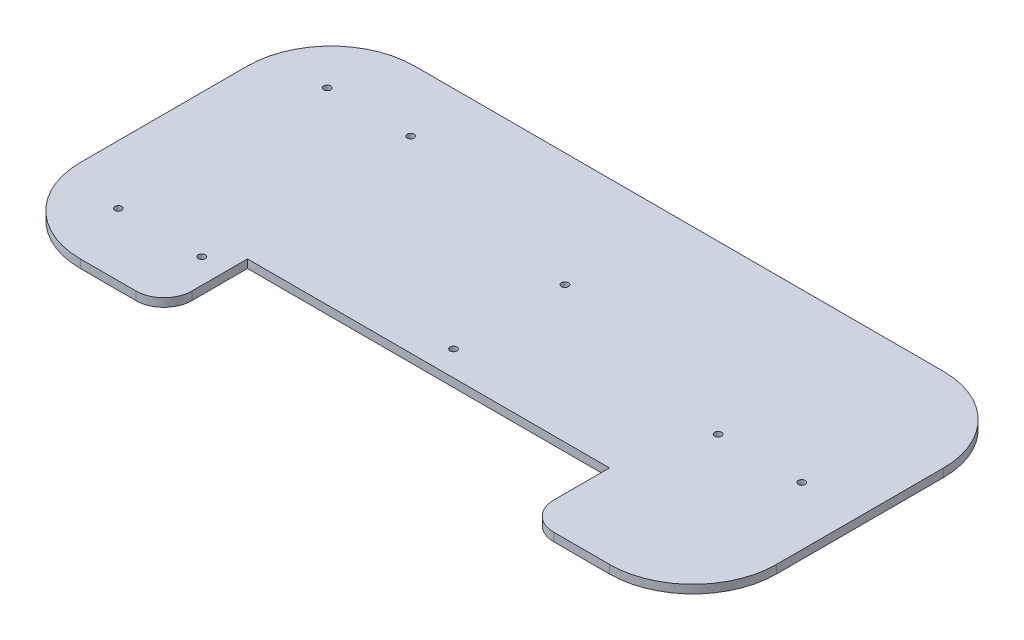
ISO-10303-21;
HEADER;
FILE_DESCRIPTION(('STEP AP214'),'2;1');
FILE_NAME('part.step','',(''),(''),'','','');
FILE_SCHEMA(('AUTOMOTIVE_DESIGN { 1 0 10303 214 1 1 1 1 }'));
ENDSEC;
DATA;
#1=APPLICATION_CONTEXT('core data for automotive mechanical design processes');
#2=APPLICATION_PROTOCOL_DEFINITION('international standard','automotive_design',2000,#1);
#3=PRODUCT_CONTEXT('',#1,'mechanical');
#4=PRODUCT('Part','Part','',(#3));
#5=PRODUCT_RELATED_PRODUCT_CATEGORY('part','',(#4));
#6=PRODUCT_DEFINITION_FORMATION('','',#4);
#7=PRODUCT_DEFINITION_CONTEXT('part definition',#1,'design');
#8=PRODUCT_DEFINITION('design','',#6,#7);
#9=PRODUCT_DEFINITION_SHAPE('','',#8);
#10=(LENGTH_UNIT() NAMED_UNIT(*) SI_UNIT(.MILLI.,.METRE.));
#11=(NAMED_UNIT(*) PLANE_ANGLE_UNIT() SI_UNIT($,.RADIAN.));
#12=(NAMED_UNIT(*) SI_UNIT($,.STERADIAN.) SOLID_ANGLE_UNIT());
#13=UNCERTAINTY_MEASURE_WITH_UNIT(LENGTH_MEASURE(1.E-05),#10,'distance_accuracy_value','');
#14=(GEOMETRIC_REPRESENTATION_CONTEXT(3) GLOBAL_UNCERTAINTY_ASSIGNED_CONTEXT((#13)) GLOBAL_UNIT_ASSIGNED_CONTEXT((#10,
#11,#12)) REPRESENTATION_CONTEXT('',''));
#15=CARTESIAN_POINT('',(0.,0.,0.));
#16=DIRECTION('',(0.,0.,1.));
#17=DIRECTION('',(1.,0.,0.));
#18=AXIS2_PLACEMENT_3D('',#15,#16,#17);
#19=CARTESIAN_POINT('',(-125.,3.,60.));
#20=DIRECTION('',(0.,0.,-1.));
#21=DIRECTION('',(-1.,0.,0.));
#22=AXIS2_PLACEMENT_3D('',#19,#20,#21);
#23=PLANE('',#22);
#24=DIRECTION('',(1.,0.,0.));
#25=VECTOR('',#24,1.);
#26=CARTESIAN_POINT('',(-125.,0.,60.));
#27=LINE('',#26,#25);
#28=CARTESIAN_POINT('',(-95.,0.,60.));
#29=VERTEX_POINT('',#28);
#30=CARTESIAN_POINT('',(-75.,0.,60.));
#31=VERTEX_POINT('',#30);
#32=EDGE_CURVE('E167',#29,#31,#27,.T.);
#33=ORIENTED_EDGE('',*,*,#32,.T.);
#34=DIRECTION('',(0.,-1.,0.));
#35=VECTOR('',#34,1.);
#36=CARTESIAN_POINT('',(-75.,3.,60.));
#37=LINE('',#36,#35);
#38=CARTESIAN_POINT('',(-75.,3.,60.));
#39=VERTEX_POINT('',#38);
#40=EDGE_CURVE('E232',#31,#39,#37,.F.);
#41=ORIENTED_EDGE('',*,*,#40,.T.);
#42=DIRECTION('',(1.,0.,0.));
#43=VECTOR('',#42,1.);
#44=CARTESIAN_POINT('',(-125.,3.,60.));
#45=LINE('',#44,#43);
#46=CARTESIAN_POINT('',(-95.,3.,60.));
#47=VERTEX_POINT('',#46);
#48=EDGE_CURVE('E174',#47,#39,#45,.T.);
#49=ORIENTED_EDGE('',*,*,#48,.F.);
#50=DIRECTION('',(0.,-1.,0.));
#51=VECTOR('',#50,1.);
#52=CARTESIAN_POINT('',(-95.,3.,60.));
#53=LINE('',#52,#51);
#54=EDGE_CURVE('E218',#47,#29,#53,.T.);
#55=ORIENTED_EDGE('',*,*,#54,.T.);
#56=EDGE_LOOP('',(#33,#41,#49,#55));
#57=FACE_BOUND('',#56,.T.);
#58=ADVANCED_FACE('F32',(#57),#23,.F.);
#59=CARTESIAN_POINT('',(125.,3.,-60.));
#60=DIRECTION('',(-1.,0.,0.));
#61=DIRECTION('',(0.,0.,1.));
#62=AXIS2_PLACEMENT_3D('',#59,#60,#61);
#63=PLANE('',#62);
#64=DIRECTION('',(0.,0.,-1.));
#65=VECTOR('',#64,1.);
#66=CARTESIAN_POINT('',(125.,0.,-60.));
#67=LINE('',#66,#65);
#68=CARTESIAN_POINT('',(125.,0.,30.));
#69=VERTEX_POINT('',#68);
#70=CARTESIAN_POINT('',(125.,0.,-30.));
#71=VERTEX_POINT('',#70);
#72=EDGE_CURVE('E162',#69,#71,#67,.T.);
#73=ORIENTED_EDGE('',*,*,#72,.T.);
#74=DIRECTION('',(0.,-1.,0.));
#75=VECTOR('',#74,1.);
#76=CARTESIAN_POINT('',(125.,3.,-30.));
#77=LINE('',#76,#75);
#78=CARTESIAN_POINT('',(125.,3.,-30.));
#79=VERTEX_POINT('',#78);
#80=EDGE_CURVE('E224',#71,#79,#77,.F.);
#81=ORIENTED_EDGE('',*,*,#80,.T.);
#82=DIRECTION('',(0.,0.,-1.));
#83=VECTOR('',#82,1.);
#84=CARTESIAN_POINT('',(125.,3.,-60.));
#85=LINE('',#84,#83);
#86=CARTESIAN_POINT('',(125.,3.,30.));
#87=VERTEX_POINT('',#86);
#88=EDGE_CURVE('E163',#87,#79,#85,.T.);
#89=ORIENTED_EDGE('',*,*,#88,.F.);
#90=DIRECTION('',(0.,-1.,0.));
#91=VECTOR('',#90,1.);
#92=CARTESIAN_POINT('',(125.,3.,30.));
#93=LINE('',#92,#91);
#94=EDGE_CURVE('E221',#87,#69,#93,.T.);
#95=ORIENTED_EDGE('',*,*,#94,.T.);
#96=EDGE_LOOP('',(#73,#81,#89,#95));
#97=FACE_BOUND('',#96,.T.);
#98=ADVANCED_FACE('F251',(#97),#63,.F.);
#99=CARTESIAN_POINT('',(-125.,3.,-60.));
#100=DIRECTION('',(0.,0.,1.));
#101=DIRECTION('',(1.,0.,0.));
#102=AXIS2_PLACEMENT_3D('',#99,#100,#101);
#103=PLANE('',#102);
#104=DIRECTION('',(-1.,0.,0.));
#105=VECTOR('',#104,1.);
#106=CARTESIAN_POINT('',(-125.,0.,-60.));
#107=LINE('',#106,#105);
#108=CARTESIAN_POINT('',(95.,0.,-60.));
#109=VERTEX_POINT('',#108);
#110=CARTESIAN_POINT('',(-95.,0.,-60.));
#111=VERTEX_POINT('',#110);
#112=EDGE_CURVE('E180',#109,#111,#107,.T.);
#113=ORIENTED_EDGE('',*,*,#112,.T.);
#114=DIRECTION('',(0.,-1.,0.));
#115=VECTOR('',#114,1.);
#116=CARTESIAN_POINT('',(-95.,3.,-60.));
#117=LINE('',#116,#115);
#118=CARTESIAN_POINT('',(-95.,3.,-60.));
#119=VERTEX_POINT('',#118);
#120=EDGE_CURVE('E205',#111,#119,#117,.F.);
#121=ORIENTED_EDGE('',*,*,#120,.T.);
#122=DIRECTION('',(-1.,0.,0.));
#123=VECTOR('',#122,1.);
#124=CARTESIAN_POINT('',(-125.,3.,-60.));
#125=LINE('',#124,#123);
#126=CARTESIAN_POINT('',(95.,3.,-60.));
#127=VERTEX_POINT('',#126);
#128=EDGE_CURVE('E166',#127,#119,#125,.T.);
#129=ORIENTED_EDGE('',*,*,#128,.F.);
#130=DIRECTION('',(0.,-1.,0.));
#131=VECTOR('',#130,1.);
#132=CARTESIAN_POINT('',(95.,3.,-60.));
#133=LINE('',#132,#131);
#134=EDGE_CURVE('E202',#127,#109,#133,.T.);
#135=ORIENTED_EDGE('',*,*,#134,.T.);
#136=EDGE_LOOP('',(#113,#121,#129,#135));
#137=FACE_BOUND('',#136,.T.);
#138=ADVANCED_FACE('F259',(#137),#103,.F.);
#139=CARTESIAN_POINT('',(-125.,3.,-60.));
#140=DIRECTION('',(1.,0.,0.));
#141=DIRECTION('',(0.,0.,-1.));
#142=AXIS2_PLACEMENT_3D('',#139,#140,#141);
#143=PLANE('',#142);
#144=DIRECTION('',(0.,0.,1.));
#145=VECTOR('',#144,1.);
#146=CARTESIAN_POINT('',(-125.,3.,-60.));
#147=LINE('',#146,#145);
#148=CARTESIAN_POINT('',(-125.,3.,-30.));
#149=VERTEX_POINT('',#148);
#150=CARTESIAN_POINT('',(-125.,3.,30.));
#151=VERTEX_POINT('',#150);
#152=EDGE_CURVE('E170',#149,#151,#147,.T.);
#153=ORIENTED_EDGE('',*,*,#152,.F.);
#154=DIRECTION('',(0.,-1.,0.));
#155=VECTOR('',#154,1.);
#156=CARTESIAN_POINT('',(-125.,3.,-30.));
#157=LINE('',#156,#155);
#158=CARTESIAN_POINT('',(-125.,0.,-30.));
#159=VERTEX_POINT('',#158);
#160=EDGE_CURVE('E190',#149,#159,#157,.T.);
#161=ORIENTED_EDGE('',*,*,#160,.T.);
#162=DIRECTION('',(0.,0.,1.));
#163=VECTOR('',#162,1.);
#164=CARTESIAN_POINT('',(-125.,0.,-60.));
#165=LINE('',#164,#163);
#166=CARTESIAN_POINT('',(-125.,0.,30.));
#167=VERTEX_POINT('',#166);
#168=EDGE_CURVE('E183',#159,#167,#165,.T.);
#169=ORIENTED_EDGE('',*,*,#168,.T.);
#170=DIRECTION('',(0.,-1.,0.));
#171=VECTOR('',#170,1.);
#172=CARTESIAN_POINT('',(-125.,3.,30.));
#173=LINE('',#172,#171);
#174=EDGE_CURVE('E177',#167,#151,#173,.F.);
#175=ORIENTED_EDGE('',*,*,#174,.T.);
#176=EDGE_LOOP('',(#153,#161,#169,#175));
#177=FACE_BOUND('',#176,.T.);
#178=ADVANCED_FACE('F268',(#177),#143,.F.);
#179=CARTESIAN_POINT('',(75.,3.,60.));
#180=VERTEX_POINT('',#179);
#181=CARTESIAN_POINT('',(95.,3.,60.));
#182=VERTEX_POINT('',#181);
#183=EDGE_CURVE('E173',#180,#182,#45,.T.);
#184=ORIENTED_EDGE('',*,*,#183,.F.);
#185=DIRECTION('',(0.,-1.,0.));
#186=VECTOR('',#185,1.);
#187=CARTESIAN_POINT('',(75.,3.,60.));
#188=LINE('',#187,#186);
#189=CARTESIAN_POINT('',(75.,0.,60.));
#190=VERTEX_POINT('',#189);
#191=EDGE_CURVE('E40',#180,#190,#188,.T.);
#192=ORIENTED_EDGE('',*,*,#191,.T.);
#193=CARTESIAN_POINT('',(95.,0.,60.));
#194=VERTEX_POINT('',#193);
#195=EDGE_CURVE('E186',#190,#194,#27,.T.);
#196=ORIENTED_EDGE('',*,*,#195,.T.);
#197=DIRECTION('',(0.,-1.,0.));
#198=VECTOR('',#197,1.);
#199=CARTESIAN_POINT('',(95.,3.,60.));
#200=LINE('',#199,#198);
#201=EDGE_CURVE('E215',#194,#182,#200,.F.);
#202=ORIENTED_EDGE('',*,*,#201,.T.);
#203=EDGE_LOOP('',(#184,#192,#196,#202));
#204=FACE_BOUND('',#203,.T.);
#205=ADVANCED_FACE('F239',(#204),#23,.F.);
#206=CARTESIAN_POINT('',(0.,3.,0.));
#207=DIRECTION('',(0.,1.,0.));
#208=DIRECTION('',(0.,0.,1.));
#209=AXIS2_PLACEMENT_3D('',#206,#207,#208);
#210=PLANE('',#209);
#211=CARTESIAN_POINT('',(104.028688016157,3.,0.));
#212=DIRECTION('',(0.,-1.,0.));
#213=DIRECTION('',(0.,0.,-1.));
#214=AXIS2_PLACEMENT_3D('',#211,#212,#213);
#215=CIRCLE('',#214,1.25);
#216=CARTESIAN_POINT('',(104.028688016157,3.,-1.25000000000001));
#217=VERTEX_POINT('',#216);
#218=EDGE_CURVE('E285',#217,#217,#215,.T.);
#219=ORIENTED_EDGE('',*,*,#218,.T.);
#220=EDGE_LOOP('',(#219));
#221=FACE_BOUND('',#220,.T.);
#222=CARTESIAN_POINT('',(-73.8835490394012,3.,-37.4999999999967));
#223=DIRECTION('',(0.,-1.,0.));
#224=DIRECTION('',(0.,0.,-1.));
#225=AXIS2_PLACEMENT_3D('',#222,#223,#224);
#226=CIRCLE('',#225,1.25);
#227=CARTESIAN_POINT('',(-73.8835490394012,3.,-38.7499999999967));
#228=VERTEX_POINT('',#227);
#229=EDGE_CURVE('E318',#228,#228,#226,.T.);
#230=ORIENTED_EDGE('',*,*,#229,.T.);
#231=EDGE_LOOP('',(#230));
#232=FACE_BOUND('',#231,.T.);
#233=CARTESIAN_POINT('',(-103.883549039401,3.,-37.4999999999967));
#234=DIRECTION('',(0.,-1.,0.));
#235=DIRECTION('',(0.,0.,-1.));
#236=AXIS2_PLACEMENT_3D('',#233,#234,#235);
#237=CIRCLE('',#236,1.25);
#238=CARTESIAN_POINT('',(-103.883549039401,3.,-38.7499999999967));
#239=VERTEX_POINT('',#238);
#240=EDGE_CURVE('E324',#239,#239,#237,.T.);
#241=ORIENTED_EDGE('',*,*,#240,.T.);
#242=EDGE_LOOP('',(#241));
#243=FACE_BOUND('',#242,.T.);
#244=CARTESIAN_POINT('',(-103.883549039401,3.,37.5000000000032));
#245=DIRECTION('',(0.,-1.,0.));
#246=DIRECTION('',(0.,0.,-1.));
#247=AXIS2_PLACEMENT_3D('',#244,#245,#246);
#248=CIRCLE('',#247,1.25);
#249=CARTESIAN_POINT('',(-103.883549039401,3.,36.2500000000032));
#250=VERTEX_POINT('',#249);
#251=EDGE_CURVE('E307',#250,#250,#248,.T.);
#252=ORIENTED_EDGE('',*,*,#251,.T.);
#253=EDGE_LOOP('',(#252));
#254=FACE_BOUND('',#253,.T.);
#255=CARTESIAN_POINT('',(74.0286880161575,3.,0.));
#256=DIRECTION('',(0.,-1.,0.));
#257=DIRECTION('',(0.,0.,-1.));
#258=AXIS2_PLACEMENT_3D('',#255,#256,#257);
#259=CIRCLE('',#258,1.25);
#260=CARTESIAN_POINT('',(74.0286880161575,3.,-1.25000000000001));
#261=VERTEX_POINT('',#260);
#262=EDGE_CURVE('E300',#261,#261,#259,.T.);
#263=ORIENTED_EDGE('',*,*,#262,.T.);
#264=EDGE_LOOP('',(#263));
#265=FACE_BOUND('',#264,.T.);
#266=CARTESIAN_POINT('',(0.,3.,20.9999999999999));
#267=DIRECTION('',(0.,-1.,0.));
#268=DIRECTION('',(0.,0.,-1.));
#269=AXIS2_PLACEMENT_3D('',#266,#267,#268);
#270=CIRCLE('',#269,1.25);
#271=CARTESIAN_POINT('',(0.,3.,19.7499999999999));
#272=VERTEX_POINT('',#271);
#273=EDGE_CURVE('E293',#272,#272,#270,.T.);
#274=ORIENTED_EDGE('',*,*,#273,.T.);
#275=EDGE_LOOP('',(#274));
#276=FACE_BOUND('',#275,.T.);
#277=CARTESIAN_POINT('',(0.,3.,-19.0000000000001));
#278=DIRECTION('',(0.,-1.,0.));
#279=DIRECTION('',(0.,0.,-1.));
#280=AXIS2_PLACEMENT_3D('',#277,#278,#279);
#281=CIRCLE('',#280,1.25);
#282=CARTESIAN_POINT('',(0.,3.,-20.2500000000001));
#283=VERTEX_POINT('',#282);
#284=EDGE_CURVE('E294',#283,#283,#281,.T.);
#285=ORIENTED_EDGE('',*,*,#284,.T.);
#286=EDGE_LOOP('',(#285));
#287=FACE_BOUND('',#286,.T.);
#288=CARTESIAN_POINT('',(-73.8835490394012,3.,37.5000000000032));
#289=DIRECTION('',(0.,-1.,0.));
#290=DIRECTION('',(0.,0.,-1.));
#291=AXIS2_PLACEMENT_3D('',#288,#289,#290);
#292=CIRCLE('',#291,1.25);
#293=CARTESIAN_POINT('',(-73.8835490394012,3.,36.2500000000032));
#294=VERTEX_POINT('',#293);
#295=EDGE_CURVE('E306',#294,#294,#292,.T.);
#296=ORIENTED_EDGE('',*,*,#295,.T.);
#297=EDGE_LOOP('',(#296));
#298=FACE_BOUND('',#297,.T.);
#299=ORIENTED_EDGE('',*,*,#48,.T.);
#300=CARTESIAN_POINT('',(-75.,3.,50.));
#301=DIRECTION('',(0.,1.,0.));
#302=DIRECTION('',(0.,0.,1.));
#303=AXIS2_PLACEMENT_3D('',#300,#301,#302);
#304=CIRCLE('',#303,10.);
#305=CARTESIAN_POINT('',(-65.,3.,50.));
#306=VERTEX_POINT('',#305);
#307=EDGE_CURVE('E235',#39,#306,#304,.T.);
#308=ORIENTED_EDGE('',*,*,#307,.T.);
#309=DIRECTION('',(0.,0.,1.));
#310=VECTOR('',#309,1.);
#311=CARTESIAN_POINT('',(-65.,3.,0.));
#312=LINE('',#311,#310);
#313=CARTESIAN_POINT('',(-65.,3.,30.));
#314=VERTEX_POINT('',#313);
#315=EDGE_CURVE('E159',#314,#306,#312,.T.);
#316=ORIENTED_EDGE('',*,*,#315,.F.);
#317=DIRECTION('',(-1.,0.,0.));
#318=VECTOR('',#317,1.);
#319=CARTESIAN_POINT('',(0.,3.,30.));
#320=LINE('',#319,#318);
#321=CARTESIAN_POINT('',(65.,3.,30.));
#322=VERTEX_POINT('',#321);
#323=EDGE_CURVE('E138',#322,#314,#320,.T.);
#324=ORIENTED_EDGE('',*,*,#323,.F.);
#325=DIRECTION('',(0.,0.,-1.));
#326=VECTOR('',#325,1.);
#327=CARTESIAN_POINT('',(65.,3.,0.));
#328=LINE('',#327,#326);
#329=CARTESIAN_POINT('',(65.,3.,50.));
#330=VERTEX_POINT('',#329);
#331=EDGE_CURVE('E135',#330,#322,#328,.T.);
#332=ORIENTED_EDGE('',*,*,#331,.F.);
#333=CARTESIAN_POINT('',(75.,3.,50.));
#334=DIRECTION('',(0.,1.,0.));
#335=DIRECTION('',(0.,0.,1.));
#336=AXIS2_PLACEMENT_3D('',#333,#334,#335);
#337=CIRCLE('',#336,10.);
#338=EDGE_CURVE('E47',#330,#180,#337,.T.);
#339=ORIENTED_EDGE('',*,*,#338,.T.);
#340=ORIENTED_EDGE('',*,*,#183,.T.);
#341=CARTESIAN_POINT('',(95.,3.,30.));
#342=DIRECTION('',(0.,1.,0.));
#343=DIRECTION('',(0.,0.,1.));
#344=AXIS2_PLACEMENT_3D('',#341,#342,#343);
#345=CIRCLE('',#344,30.);
#346=EDGE_CURVE('E207',#182,#87,#345,.T.);
#347=ORIENTED_EDGE('',*,*,#346,.T.);
#348=ORIENTED_EDGE('',*,*,#88,.T.);
#349=CARTESIAN_POINT('',(95.,3.,-30.));
#350=DIRECTION('',(0.,1.,0.));
#351=DIRECTION('',(0.,0.,1.));
#352=AXIS2_PLACEMENT_3D('',#349,#350,#351);
#353=CIRCLE('',#352,30.);
#354=EDGE_CURVE('E209',#79,#127,#353,.T.);
#355=ORIENTED_EDGE('',*,*,#354,.T.);
#356=ORIENTED_EDGE('',*,*,#128,.T.);
#357=CARTESIAN_POINT('',(-95.,3.,-30.));
#358=DIRECTION('',(0.,1.,0.));
#359=DIRECTION('',(0.,0.,1.));
#360=AXIS2_PLACEMENT_3D('',#357,#358,#359);
#361=CIRCLE('',#360,30.);
#362=EDGE_CURVE('E213',#119,#149,#361,.T.);
#363=ORIENTED_EDGE('',*,*,#362,.T.);
#364=ORIENTED_EDGE('',*,*,#152,.T.);
#365=CARTESIAN_POINT('',(-95.,3.,30.));
#366=DIRECTION('',(0.,1.,0.));
#367=DIRECTION('',(0.,0.,1.));
#368=AXIS2_PLACEMENT_3D('',#365,#366,#367);
#369=CIRCLE('',#368,30.);
#370=EDGE_CURVE('E211',#151,#47,#369,.T.);
#371=ORIENTED_EDGE('',*,*,#370,.T.);
#372=EDGE_LOOP('',(#299,#308,#316,#324,#332,#339,#340,#347,#348,#355,#356,#363,#364,#371));
#373=FACE_BOUND('',#372,.T.);
#374=ADVANCED_FACE('F248',(#221,#232,#243,#254,#265,#276,#287,#298,#373),#210,.T.);
#375=CARTESIAN_POINT('',(0.,0.,0.));
#376=DIRECTION('',(0.,1.,0.));
#377=DIRECTION('',(0.,0.,1.));
#378=AXIS2_PLACEMENT_3D('',#375,#376,#377);
#379=PLANE('',#378);
#380=CARTESIAN_POINT('',(104.028688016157,0.,0.));
#381=DIRECTION('',(0.,-1.,0.));
#382=DIRECTION('',(0.,0.,-1.));
#383=AXIS2_PLACEMENT_3D('',#380,#381,#382);
#384=CIRCLE('',#383,1.25);
#385=CARTESIAN_POINT('',(104.028688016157,0.,-1.25000000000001));
#386=VERTEX_POINT('',#385);
#387=EDGE_CURVE('E287',#386,#386,#384,.T.);
#388=ORIENTED_EDGE('',*,*,#387,.F.);
#389=EDGE_LOOP('',(#388));
#390=FACE_BOUND('',#389,.T.);
#391=CARTESIAN_POINT('',(-73.8835490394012,0.,-37.4999999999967));
#392=DIRECTION('',(0.,-1.,0.));
#393=DIRECTION('',(0.,0.,-1.));
#394=AXIS2_PLACEMENT_3D('',#391,#392,#393);
#395=CIRCLE('',#394,1.25);
#396=CARTESIAN_POINT('',(-73.8835490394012,0.,-38.7499999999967));
#397=VERTEX_POINT('',#396);
#398=EDGE_CURVE('E315',#397,#397,#395,.T.);
#399=ORIENTED_EDGE('',*,*,#398,.F.);
#400=EDGE_LOOP('',(#399));
#401=FACE_BOUND('',#400,.T.);
#402=CARTESIAN_POINT('',(-103.883549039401,0.,-37.4999999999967));
#403=DIRECTION('',(0.,-1.,0.));
#404=DIRECTION('',(0.,0.,-1.));
#405=AXIS2_PLACEMENT_3D('',#402,#403,#404);
#406=CIRCLE('',#405,1.25);
#407=CARTESIAN_POINT('',(-103.883549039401,0.,-38.7499999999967));
#408=VERTEX_POINT('',#407);
#409=EDGE_CURVE('E321',#408,#408,#406,.T.);
#410=ORIENTED_EDGE('',*,*,#409,.F.);
#411=EDGE_LOOP('',(#410));
#412=FACE_BOUND('',#411,.T.);
#413=CARTESIAN_POINT('',(-103.883549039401,0.,37.5000000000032));
#414=DIRECTION('',(0.,-1.,0.));
#415=DIRECTION('',(0.,0.,-1.));
#416=AXIS2_PLACEMENT_3D('',#413,#414,#415);
#417=CIRCLE('',#416,1.25);
#418=CARTESIAN_POINT('',(-103.883549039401,0.,36.2500000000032));
#419=VERTEX_POINT('',#418);
#420=EDGE_CURVE('E327',#419,#419,#417,.T.);
#421=ORIENTED_EDGE('',*,*,#420,.F.);
#422=EDGE_LOOP('',(#421));
#423=FACE_BOUND('',#422,.T.);
#424=CARTESIAN_POINT('',(74.0286880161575,0.,0.));
#425=DIRECTION('',(0.,-1.,0.));
#426=DIRECTION('',(0.,0.,-1.));
#427=AXIS2_PLACEMENT_3D('',#424,#425,#426);
#428=CIRCLE('',#427,1.25);
#429=CARTESIAN_POINT('',(74.0286880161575,0.,-1.25000000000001));
#430=VERTEX_POINT('',#429);
#431=EDGE_CURVE('E297',#430,#430,#428,.T.);
#432=ORIENTED_EDGE('',*,*,#431,.F.);
#433=EDGE_LOOP('',(#432));
#434=FACE_BOUND('',#433,.T.);
#435=CARTESIAN_POINT('',(0.,0.,20.9999999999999));
#436=DIRECTION('',(0.,-1.,0.));
#437=DIRECTION('',(0.,0.,-1.));
#438=AXIS2_PLACEMENT_3D('',#435,#436,#437);
#439=CIRCLE('',#438,1.25);
#440=CARTESIAN_POINT('',(0.,0.,19.7499999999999));
#441=VERTEX_POINT('',#440);
#442=EDGE_CURVE('E290',#441,#441,#439,.T.);
#443=ORIENTED_EDGE('',*,*,#442,.F.);
#444=EDGE_LOOP('',(#443));
#445=FACE_BOUND('',#444,.T.);
#446=CARTESIAN_POINT('',(0.,0.,-19.0000000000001));
#447=DIRECTION('',(0.,-1.,0.));
#448=DIRECTION('',(0.,0.,-1.));
#449=AXIS2_PLACEMENT_3D('',#446,#447,#448);
#450=CIRCLE('',#449,1.25);
#451=CARTESIAN_POINT('',(0.,0.,-20.2500000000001));
#452=VERTEX_POINT('',#451);
#453=EDGE_CURVE('E310',#452,#452,#450,.T.);
#454=ORIENTED_EDGE('',*,*,#453,.F.);
#455=EDGE_LOOP('',(#454));
#456=FACE_BOUND('',#455,.T.);
#457=CARTESIAN_POINT('',(-73.8835490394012,0.,37.5000000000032));
#458=DIRECTION('',(0.,-1.,0.));
#459=DIRECTION('',(0.,0.,-1.));
#460=AXIS2_PLACEMENT_3D('',#457,#458,#459);
#461=CIRCLE('',#460,1.25);
#462=CARTESIAN_POINT('',(-73.8835490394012,0.,36.2500000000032));
#463=VERTEX_POINT('',#462);
#464=EDGE_CURVE('E303',#463,#463,#461,.T.);
#465=ORIENTED_EDGE('',*,*,#464,.F.);
#466=EDGE_LOOP('',(#465));
#467=FACE_BOUND('',#466,.T.);
#468=DIRECTION('',(0.,0.,-1.));
#469=VECTOR('',#468,1.);
#470=CARTESIAN_POINT('',(-65.,0.,60.));
#471=LINE('',#470,#469);
#472=CARTESIAN_POINT('',(-65.,0.,50.));
#473=VERTEX_POINT('',#472);
#474=CARTESIAN_POINT('',(-65.,0.,30.));
#475=VERTEX_POINT('',#474);
#476=EDGE_CURVE('E148',#473,#475,#471,.T.);
#477=ORIENTED_EDGE('',*,*,#476,.F.);
#478=CARTESIAN_POINT('',(-75.,0.,50.));
#479=DIRECTION('',(0.,1.,0.));
#480=DIRECTION('',(0.,0.,1.));
#481=AXIS2_PLACEMENT_3D('',#478,#479,#480);
#482=CIRCLE('',#481,10.);
#483=EDGE_CURVE('E230',#473,#31,#482,.F.);
#484=ORIENTED_EDGE('',*,*,#483,.T.);
#485=ORIENTED_EDGE('',*,*,#32,.F.);
#486=CARTESIAN_POINT('',(-95.,0.,30.));
#487=DIRECTION('',(0.,1.,0.));
#488=DIRECTION('',(0.,0.,1.));
#489=AXIS2_PLACEMENT_3D('',#486,#487,#488);
#490=CIRCLE('',#489,30.);
#491=EDGE_CURVE('E198',#29,#167,#490,.F.);
#492=ORIENTED_EDGE('',*,*,#491,.T.);
#493=ORIENTED_EDGE('',*,*,#168,.F.);
#494=CARTESIAN_POINT('',(-95.,0.,-30.));
#495=DIRECTION('',(0.,1.,0.));
#496=DIRECTION('',(0.,0.,1.));
#497=AXIS2_PLACEMENT_3D('',#494,#495,#496);
#498=CIRCLE('',#497,30.);
#499=EDGE_CURVE('E200',#159,#111,#498,.F.);
#500=ORIENTED_EDGE('',*,*,#499,.T.);
#501=ORIENTED_EDGE('',*,*,#112,.F.);
#502=CARTESIAN_POINT('',(95.,0.,-30.));
#503=DIRECTION('',(0.,1.,0.));
#504=DIRECTION('',(0.,0.,1.));
#505=AXIS2_PLACEMENT_3D('',#502,#503,#504);
#506=CIRCLE('',#505,30.);
#507=EDGE_CURVE('E196',#109,#71,#506,.F.);
#508=ORIENTED_EDGE('',*,*,#507,.T.);
#509=ORIENTED_EDGE('',*,*,#72,.F.);
#510=CARTESIAN_POINT('',(95.,0.,30.));
#511=DIRECTION('',(0.,1.,0.));
#512=DIRECTION('',(0.,0.,1.));
#513=AXIS2_PLACEMENT_3D('',#510,#511,#512);
#514=CIRCLE('',#513,30.);
#515=EDGE_CURVE('E193',#69,#194,#514,.F.);
#516=ORIENTED_EDGE('',*,*,#515,.T.);
#517=ORIENTED_EDGE('',*,*,#195,.F.);
#518=CARTESIAN_POINT('',(75.,0.,50.));
#519=DIRECTION('',(0.,1.,0.));
#520=DIRECTION('',(0.,0.,1.));
#521=AXIS2_PLACEMENT_3D('',#518,#519,#520);
#522=CIRCLE('',#521,10.);
#523=CARTESIAN_POINT('',(65.,0.,50.));
#524=VERTEX_POINT('',#523);
#525=EDGE_CURVE('E152',#190,#524,#522,.F.);
#526=ORIENTED_EDGE('',*,*,#525,.T.);
#527=DIRECTION('',(0.,0.,1.));
#528=VECTOR('',#527,1.);
#529=CARTESIAN_POINT('',(65.,0.,60.));
#530=LINE('',#529,#528);
#531=CARTESIAN_POINT('',(65.,0.,30.));
#532=VERTEX_POINT('',#531);
#533=EDGE_CURVE('E134',#532,#524,#530,.T.);
#534=ORIENTED_EDGE('',*,*,#533,.F.);
#535=DIRECTION('',(1.,0.,0.));
#536=VECTOR('',#535,1.);
#537=CARTESIAN_POINT('',(-65.,0.,30.));
#538=LINE('',#537,#536);
#539=EDGE_CURVE('E143',#475,#532,#538,.T.);
#540=ORIENTED_EDGE('',*,*,#539,.F.);
#541=EDGE_LOOP('',(#477,#484,#485,#492,#493,#500,#501,#508,#509,#516,#517,#526,#534,#540));
#542=FACE_BOUND('',#541,.T.);
#543=ADVANCED_FACE('F150',(#390,#401,#412,#423,#434,#445,#456,#467,#542),#379,.F.);
#544=CARTESIAN_POINT('',(-95.,3.,-30.));
#545=DIRECTION('',(0.,-1.,0.));
#546=DIRECTION('',(0.,0.,-1.));
#547=AXIS2_PLACEMENT_3D('',#544,#545,#546);
#548=CYLINDRICAL_SURFACE('',#547,30.);
#549=ORIENTED_EDGE('',*,*,#362,.F.);
#550=ORIENTED_EDGE('',*,*,#120,.F.);
#551=ORIENTED_EDGE('',*,*,#499,.F.);
#552=ORIENTED_EDGE('',*,*,#160,.F.);
#553=EDGE_LOOP('',(#549,#550,#551,#552));
#554=FACE_BOUND('',#553,.T.);
#555=ADVANCED_FACE('F263',(#554),#548,.T.);
#556=CARTESIAN_POINT('',(-95.,3.,30.));
#557=DIRECTION('',(0.,-1.,0.));
#558=DIRECTION('',(0.,0.,-1.));
#559=AXIS2_PLACEMENT_3D('',#556,#557,#558);
#560=CYLINDRICAL_SURFACE('',#559,30.);
#561=ORIENTED_EDGE('',*,*,#370,.F.);
#562=ORIENTED_EDGE('',*,*,#174,.F.);
#563=ORIENTED_EDGE('',*,*,#491,.F.);
#564=ORIENTED_EDGE('',*,*,#54,.F.);
#565=EDGE_LOOP('',(#561,#562,#563,#564));
#566=FACE_BOUND('',#565,.T.);
#567=ADVANCED_FACE('F272',(#566),#560,.T.);
#568=CARTESIAN_POINT('',(95.,3.,-30.));
#569=DIRECTION('',(0.,-1.,0.));
#570=DIRECTION('',(0.,0.,-1.));
#571=AXIS2_PLACEMENT_3D('',#568,#569,#570);
#572=CYLINDRICAL_SURFACE('',#571,30.);
#573=ORIENTED_EDGE('',*,*,#354,.F.);
#574=ORIENTED_EDGE('',*,*,#80,.F.);
#575=ORIENTED_EDGE('',*,*,#507,.F.);
#576=ORIENTED_EDGE('',*,*,#134,.F.);
#577=EDGE_LOOP('',(#573,#574,#575,#576));
#578=FACE_BOUND('',#577,.T.);
#579=ADVANCED_FACE('F254',(#578),#572,.T.);
#580=CARTESIAN_POINT('',(95.,3.,30.));
#581=DIRECTION('',(0.,-1.,0.));
#582=DIRECTION('',(0.,0.,-1.));
#583=AXIS2_PLACEMENT_3D('',#580,#581,#582);
#584=CYLINDRICAL_SURFACE('',#583,30.);
#585=ORIENTED_EDGE('',*,*,#346,.F.);
#586=ORIENTED_EDGE('',*,*,#201,.F.);
#587=ORIENTED_EDGE('',*,*,#515,.F.);
#588=ORIENTED_EDGE('',*,*,#94,.F.);
#589=EDGE_LOOP('',(#585,#586,#587,#588));
#590=FACE_BOUND('',#589,.T.);
#591=ADVANCED_FACE('F246',(#590),#584,.T.);
#592=CARTESIAN_POINT('',(-65.,10.,60.));
#593=DIRECTION('',(-1.,0.,0.));
#594=DIRECTION('',(0.,0.,1.));
#595=AXIS2_PLACEMENT_3D('',#592,#593,#594);
#596=PLANE('',#595);
#597=ORIENTED_EDGE('',*,*,#315,.T.);
#598=DIRECTION('',(0.,-1.,0.));
#599=VECTOR('',#598,1.);
#600=CARTESIAN_POINT('',(-65.,10.,50.));
#601=LINE('',#600,#599);
#602=EDGE_CURVE('E226',#306,#473,#601,.T.);
#603=ORIENTED_EDGE('',*,*,#602,.T.);
#604=ORIENTED_EDGE('',*,*,#476,.T.);
#605=DIRECTION('',(0.,-1.,0.));
#606=VECTOR('',#605,1.);
#607=CARTESIAN_POINT('',(-65.,10.,30.));
#608=LINE('',#607,#606);
#609=EDGE_CURVE('E139',#314,#475,#608,.T.);
#610=ORIENTED_EDGE('',*,*,#609,.F.);
#611=EDGE_LOOP('',(#597,#603,#604,#610));
#612=FACE_BOUND('',#611,.T.);
#613=ADVANCED_FACE('F284',(#612),#596,.F.);
#614=CARTESIAN_POINT('',(65.,10.,60.));
#615=DIRECTION('',(1.,0.,0.));
#616=DIRECTION('',(0.,0.,-1.));
#617=AXIS2_PLACEMENT_3D('',#614,#615,#616);
#618=PLANE('',#617);
#619=ORIENTED_EDGE('',*,*,#533,.T.);
#620=DIRECTION('',(0.,-1.,0.));
#621=VECTOR('',#620,1.);
#622=CARTESIAN_POINT('',(65.,10.,50.));
#623=LINE('',#622,#621);
#624=EDGE_CURVE('E11',#524,#330,#623,.F.);
#625=ORIENTED_EDGE('',*,*,#624,.T.);
#626=ORIENTED_EDGE('',*,*,#331,.T.);
#627=DIRECTION('',(0.,-1.,0.));
#628=VECTOR('',#627,1.);
#629=CARTESIAN_POINT('',(65.,10.,30.));
#630=LINE('',#629,#628);
#631=EDGE_CURVE('E130',#322,#532,#630,.T.);
#632=ORIENTED_EDGE('',*,*,#631,.T.);
#633=EDGE_LOOP('',(#619,#625,#626,#632));
#634=FACE_BOUND('',#633,.T.);
#635=ADVANCED_FACE('F132',(#634),#618,.F.);
#636=CARTESIAN_POINT('',(-65.,10.,30.));
#637=DIRECTION('',(0.,0.,-1.));
#638=DIRECTION('',(-1.,0.,0.));
#639=AXIS2_PLACEMENT_3D('',#636,#637,#638);
#640=PLANE('',#639);
#641=ORIENTED_EDGE('',*,*,#323,.T.);
#642=ORIENTED_EDGE('',*,*,#609,.T.);
#643=ORIENTED_EDGE('',*,*,#539,.T.);
#644=ORIENTED_EDGE('',*,*,#631,.F.);
#645=EDGE_LOOP('',(#641,#642,#643,#644));
#646=FACE_BOUND('',#645,.T.);
#647=ADVANCED_FACE('F144',(#646),#640,.F.);
#648=CARTESIAN_POINT('',(-75.,10.,50.));
#649=DIRECTION('',(0.,-1.,0.));
#650=DIRECTION('',(0.,0.,-1.));
#651=AXIS2_PLACEMENT_3D('',#648,#649,#650);
#652=CYLINDRICAL_SURFACE('',#651,10.);
#653=ORIENTED_EDGE('',*,*,#307,.F.);
#654=ORIENTED_EDGE('',*,*,#40,.F.);
#655=ORIENTED_EDGE('',*,*,#483,.F.);
#656=ORIENTED_EDGE('',*,*,#602,.F.);
#657=EDGE_LOOP('',(#653,#654,#655,#656));
#658=FACE_BOUND('',#657,.T.);
#659=ADVANCED_FACE('F280',(#658),#652,.T.);
#660=CARTESIAN_POINT('',(75.,3.,50.));
#661=DIRECTION('',(0.,-1.,0.));
#662=DIRECTION('',(0.,0.,-1.));
#663=AXIS2_PLACEMENT_3D('',#660,#661,#662);
#664=CYLINDRICAL_SURFACE('',#663,10.);
#665=ORIENTED_EDGE('',*,*,#338,.F.);
#666=ORIENTED_EDGE('',*,*,#624,.F.);
#667=ORIENTED_EDGE('',*,*,#525,.F.);
#668=ORIENTED_EDGE('',*,*,#191,.F.);
#669=EDGE_LOOP('',(#665,#666,#667,#668));
#670=FACE_BOUND('',#669,.T.);
#671=ADVANCED_FACE('F34',(#670),#664,.T.);
#672=CARTESIAN_POINT('',(-73.8835490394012,3.,37.5000000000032));
#673=DIRECTION('',(0.,-1.,0.));
#674=DIRECTION('',(0.,0.,-1.));
#675=AXIS2_PLACEMENT_3D('',#672,#673,#674);
#676=CYLINDRICAL_SURFACE('',#675,1.25);
#677=ORIENTED_EDGE('',*,*,#295,.F.);
#678=EDGE_LOOP('',(#677));
#679=FACE_BOUND('',#678,.T.);
#680=ORIENTED_EDGE('',*,*,#464,.T.);
#681=EDGE_LOOP('',(#680));
#682=FACE_BOUND('',#681,.T.);
#683=ADVANCED_FACE('F354',(#679,#682),#676,.F.);
#684=CARTESIAN_POINT('',(0.,3.,-19.0000000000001));
#685=DIRECTION('',(0.,-1.,0.));
#686=DIRECTION('',(0.,0.,-1.));
#687=AXIS2_PLACEMENT_3D('',#684,#685,#686);
#688=CYLINDRICAL_SURFACE('',#687,1.25);
#689=ORIENTED_EDGE('',*,*,#284,.F.);
#690=EDGE_LOOP('',(#689));
#691=FACE_BOUND('',#690,.T.);
#692=ORIENTED_EDGE('',*,*,#453,.T.);
#693=EDGE_LOOP('',(#692));
#694=FACE_BOUND('',#693,.T.);
#695=ADVANCED_FACE('F356',(#691,#694),#688,.F.);
#696=CARTESIAN_POINT('',(0.,3.,20.9999999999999));
#697=DIRECTION('',(0.,-1.,0.));
#698=DIRECTION('',(0.,0.,-1.));
#699=AXIS2_PLACEMENT_3D('',#696,#697,#698);
#700=CYLINDRICAL_SURFACE('',#699,1.25);
#701=ORIENTED_EDGE('',*,*,#273,.F.);
#702=EDGE_LOOP('',(#701));
#703=FACE_BOUND('',#702,.T.);
#704=ORIENTED_EDGE('',*,*,#442,.T.);
#705=EDGE_LOOP('',(#704));
#706=FACE_BOUND('',#705,.T.);
#707=ADVANCED_FACE('F363',(#703,#706),#700,.F.);
#708=CARTESIAN_POINT('',(74.0286880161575,3.,0.));
#709=DIRECTION('',(0.,-1.,0.));
#710=DIRECTION('',(0.,0.,-1.));
#711=AXIS2_PLACEMENT_3D('',#708,#709,#710);
#712=CYLINDRICAL_SURFACE('',#711,1.25);
#713=ORIENTED_EDGE('',*,*,#262,.F.);
#714=EDGE_LOOP('',(#713));
#715=FACE_BOUND('',#714,.T.);
#716=ORIENTED_EDGE('',*,*,#431,.T.);
#717=EDGE_LOOP('',(#716));
#718=FACE_BOUND('',#717,.T.);
#719=ADVANCED_FACE('F458',(#715,#718),#712,.F.);
#720=CARTESIAN_POINT('',(-103.883549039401,3.,37.5000000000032));
#721=DIRECTION('',(0.,-1.,0.));
#722=DIRECTION('',(0.,0.,-1.));
#723=AXIS2_PLACEMENT_3D('',#720,#721,#722);
#724=CYLINDRICAL_SURFACE('',#723,1.25);
#725=ORIENTED_EDGE('',*,*,#251,.F.);
#726=EDGE_LOOP('',(#725));
#727=FACE_BOUND('',#726,.T.);
#728=ORIENTED_EDGE('',*,*,#420,.T.);
#729=EDGE_LOOP('',(#728));
#730=FACE_BOUND('',#729,.T.);
#731=ADVANCED_FACE('F467',(#727,#730),#724,.F.);
#732=CARTESIAN_POINT('',(-103.883549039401,3.,-37.4999999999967));
#733=DIRECTION('',(0.,-1.,0.));
#734=DIRECTION('',(0.,0.,-1.));
#735=AXIS2_PLACEMENT_3D('',#732,#733,#734);
#736=CYLINDRICAL_SURFACE('',#735,1.25);
#737=ORIENTED_EDGE('',*,*,#240,.F.);
#738=EDGE_LOOP('',(#737));
#739=FACE_BOUND('',#738,.T.);
#740=ORIENTED_EDGE('',*,*,#409,.T.);
#741=EDGE_LOOP('',(#740));
#742=FACE_BOUND('',#741,.T.);
#743=ADVANCED_FACE('F476',(#739,#742),#736,.F.);
#744=CARTESIAN_POINT('',(-73.8835490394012,3.,-37.4999999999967));
#745=DIRECTION('',(0.,-1.,0.));
#746=DIRECTION('',(0.,0.,-1.));
#747=AXIS2_PLACEMENT_3D('',#744,#745,#746);
#748=CYLINDRICAL_SURFACE('',#747,1.25);
#749=ORIENTED_EDGE('',*,*,#229,.F.);
#750=EDGE_LOOP('',(#749));
#751=FACE_BOUND('',#750,.T.);
#752=ORIENTED_EDGE('',*,*,#398,.T.);
#753=EDGE_LOOP('',(#752));
#754=FACE_BOUND('',#753,.T.);
#755=ADVANCED_FACE('F486',(#751,#754),#748,.F.);
#756=CARTESIAN_POINT('',(104.028688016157,3.,0.));
#757=DIRECTION('',(0.,-1.,0.));
#758=DIRECTION('',(0.,0.,-1.));
#759=AXIS2_PLACEMENT_3D('',#756,#757,#758);
#760=CYLINDRICAL_SURFACE('',#759,1.25);
#761=ORIENTED_EDGE('',*,*,#218,.F.);
#762=EDGE_LOOP('',(#761));
#763=FACE_BOUND('',#762,.T.);
#764=ORIENTED_EDGE('',*,*,#387,.T.);
#765=EDGE_LOOP('',(#764));
#766=FACE_BOUND('',#765,.T.);
#767=ADVANCED_FACE('F335',(#763,#766),#760,.F.);
#768=CLOSED_SHELL('',(#58,#98,#138,#178,#205,#374,#543,#555,#567,#579,#591,#613,#635,#647,#659,
#671,#683,#695,#707,#719,#731,#743,#755,#767));
#769=MANIFOLD_SOLID_BREP('B2',#768);
#770=ADVANCED_BREP_SHAPE_REPRESENTATION('',(#18,#769),#14);
#771=SHAPE_DEFINITION_REPRESENTATION(#9,#770);
ENDSEC;
END-ISO-10303-21;
